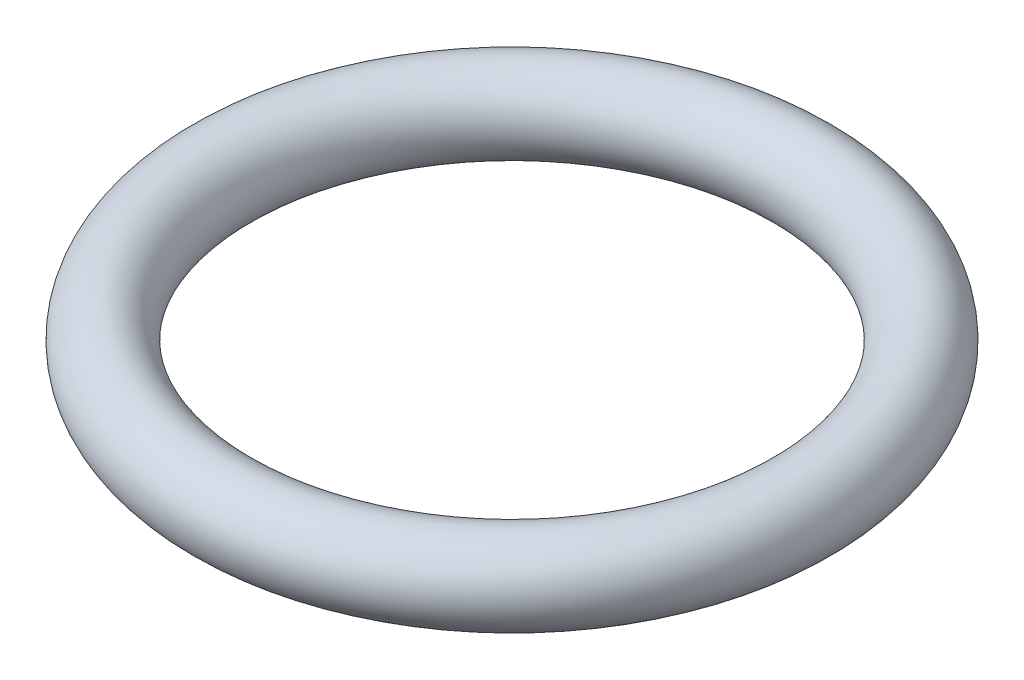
ISO-10303-21;
HEADER;
FILE_DESCRIPTION(('STEP AP214'),'2;1');
FILE_NAME('part.step','',(''),(''),'','','');
FILE_SCHEMA(('AUTOMOTIVE_DESIGN { 1 0 10303 214 1 1 1 1 }'));
ENDSEC;
DATA;
#1=APPLICATION_CONTEXT('core data for automotive mechanical design processes');
#2=APPLICATION_PROTOCOL_DEFINITION('international standard','automotive_design',2000,#1);
#3=PRODUCT_CONTEXT('',#1,'mechanical');
#4=PRODUCT('Part','Part','',(#3));
#5=PRODUCT_RELATED_PRODUCT_CATEGORY('part','',(#4));
#6=PRODUCT_DEFINITION_FORMATION('','',#4);
#7=PRODUCT_DEFINITION_CONTEXT('part definition',#1,'design');
#8=PRODUCT_DEFINITION('design','',#6,#7);
#9=PRODUCT_DEFINITION_SHAPE('','',#8);
#10=(LENGTH_UNIT() NAMED_UNIT(*) SI_UNIT(.MILLI.,.METRE.));
#11=(NAMED_UNIT(*) PLANE_ANGLE_UNIT() SI_UNIT($,.RADIAN.));
#12=(NAMED_UNIT(*) SI_UNIT($,.STERADIAN.) SOLID_ANGLE_UNIT());
#13=UNCERTAINTY_MEASURE_WITH_UNIT(LENGTH_MEASURE(1.E-05),#10,'distance_accuracy_value','');
#14=(GEOMETRIC_REPRESENTATION_CONTEXT(3) GLOBAL_UNCERTAINTY_ASSIGNED_CONTEXT((#13)) GLOBAL_UNIT_ASSIGNED_CONTEXT((#10,
#11,#12)) REPRESENTATION_CONTEXT('',''));
#15=CARTESIAN_POINT('',(0.,0.,0.));
#16=DIRECTION('',(0.,0.,1.));
#17=DIRECTION('',(1.,0.,0.));
#18=AXIS2_PLACEMENT_3D('',#15,#16,#17);
#19=CARTESIAN_POINT('',(3.88902869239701,25.2189916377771,0.));
#20=DIRECTION('',(0.,1.,0.));
#21=DIRECTION('',(0.,0.,1.));
#22=AXIS2_PLACEMENT_3D('',#19,#20,#21);
#23=TOROIDAL_SURFACE('',#22,5.26794919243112,0.73205080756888);
#24=CARTESIAN_POINT('',(3.88902869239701,25.2189916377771,6.));
#25=VERTEX_POINT('',#24);
#26=VERTEX_LOOP('',#25);
#27=FACE_BOUND('',#26,.T.);
#28=ADVANCED_FACE('F27',(#27),#23,.T.);
#29=CLOSED_SHELL('',(#28));
#30=MANIFOLD_SOLID_BREP('B2',#29);
#31=ADVANCED_BREP_SHAPE_REPRESENTATION('',(#18,#30),#14);
#32=SHAPE_DEFINITION_REPRESENTATION(#9,#31);
ENDSEC;
END-ISO-10303-21;
